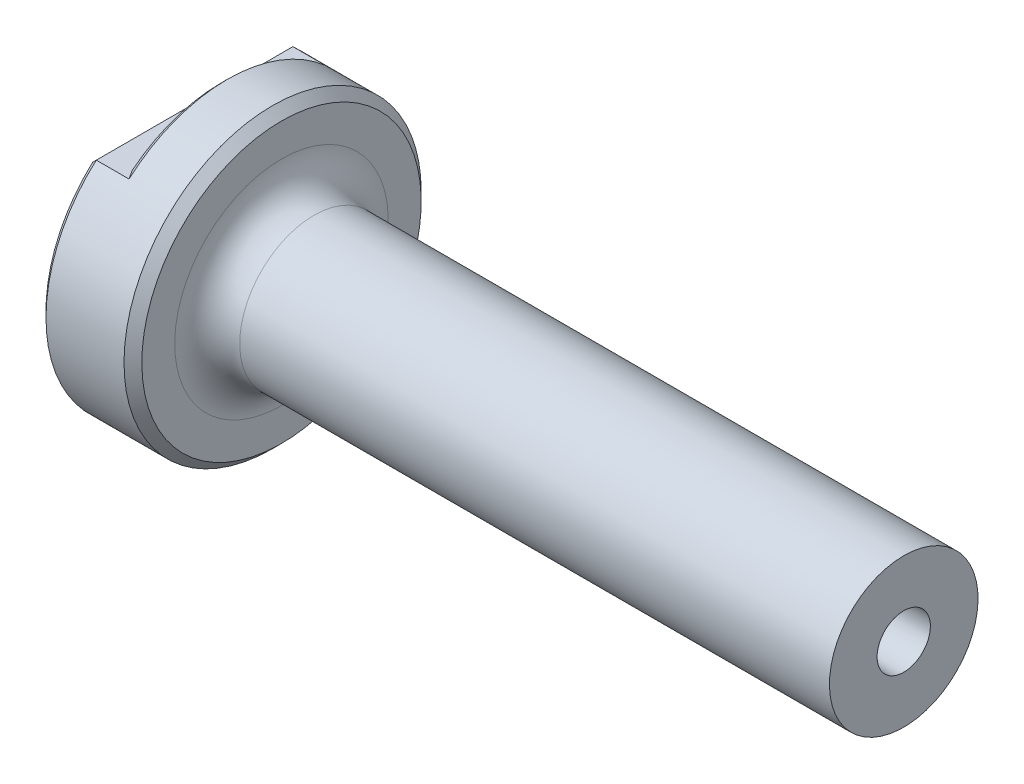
from build123d import *

# Parameters (mm, degrees)
SKETCH1_R           = 25.4
BOSS_EXTRUDE1_DEPTH = 61.11875
SKETCH3_W           = 50.8
SKETCH3_H           = 6.35
CUT_EXTRUDE1_DEPTH  = 5.588
SKETCH5_W           = 106.3625
SKETCH5_H           = 12.7
FILLET1_R           = 5.55625
CHAMFER1_SIZE       = 1.524
CHAMFER2_SIZE       = 1.016


with BuildPart() as part:
    # Sketch1 → Boss-Extrude1 (new, symmetric)
    with BuildSketch(Plane(origin=(0, 0, 0), x_dir=(0, 0, -1), z_dir=(1, 0, 0))):
        Circle(SKETCH1_R)
    extrude(amount=BOSS_EXTRUDE1_DEPTH, both=True)

    # Sketch3 → Cut-Extrude1 (cut)
    with BuildSketch(Plane.ZY.offset(61.11875)):
        with Locations((0, 22.225)):
            Rectangle(SKETCH3_W, SKETCH3_H)
    extrude(amount=-CUT_EXTRUDE1_DEPTH, mode=Mode.SUBTRACT)

    # Sketch5 → Cut-Revolve1 (revolve, cut)
    with BuildSketch(Plane.XY, mode=Mode.PRIVATE) as cut_revolve1_sk:
        with Locations((7.9375, -19.05)):
            Rectangle(SKETCH5_W, SKETCH5_H)
    revolve(cut_revolve1_sk.sketch.rotate(Axis((61.11875, 0, 0), (-1, 0, 0)), 138.590377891), axis=Axis((61.11875, 0, 0), (-1, 0, 0)), mode=Mode.SUBTRACT)

    # Sketch6 → Cut-Revolve2 (revolve, cut)
    with BuildSketch(Plane.XY):
        with BuildLine():
            Line((-56.49595, 0), (-61.11875, 0))
            Line((-61.11875, 0), (-61.11875, 9.800451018))
            ThreePointArc((-61.11875, 9.800451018), (-57.709644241, 5.418005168), (-56.49595, 0))
        make_face()
    revolve(axis=Axis((61.11875, 0, 0), (-1, 0, 0)), mode=Mode.SUBTRACT)

    # Sketch7 → Cut-Revolve3 (revolve, cut)
    with BuildSketch(Plane.XY):
        Polygon((-56.651937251, 1.984375), (61.11875, 4.554140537), (61.11875, 0), (-56.651937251, 0), align=None)
    revolve(axis=Axis((61.11875, 0, 0), (-1, 0, 0)), mode=Mode.SUBTRACT)

    # Fillet1
    fillet1_edges = [part.edges().sort_by_distance(p)[0] for p in [
        (-45.24375, -9.525, -8.400260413),
    ]]
    fillet(fillet1_edges, radius=FILLET1_R)

    # Chamfer1
    chamfer1_edges = [part.edges().sort_by_distance(p)[0] for p in [
        (-45.24375, 0, 25.4),
    ]]
    chamfer(chamfer1_edges, length=CHAMFER1_SIZE)

    # Chamfer2
    chamfer2_edges = [part.edges().sort_by_distance(p)[0] for p in [
        (-61.11875, -23.150520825, 10.450520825),
        (-61.11875, 19.05, 0),
        (-55.53075, 25.4, 0),
    ]]
    chamfer(chamfer2_edges, length=CHAMFER2_SIZE)


solid = part.part
